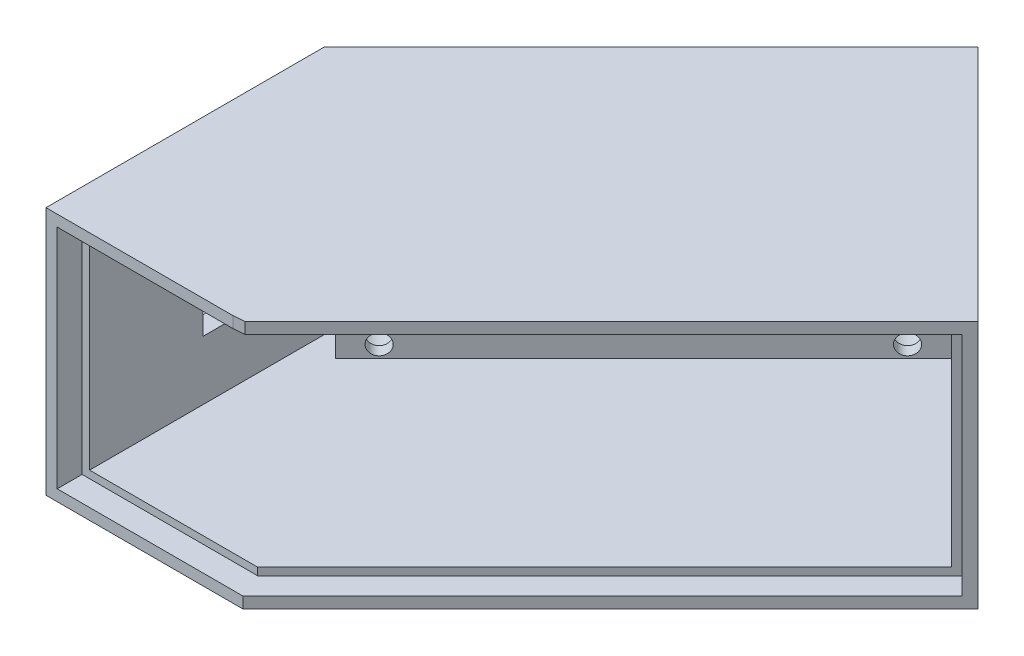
ISO-10303-21;
HEADER;
FILE_DESCRIPTION(('STEP AP214'),'2;1');
FILE_NAME('part.step','',(''),(''),'','','');
FILE_SCHEMA(('AUTOMOTIVE_DESIGN { 1 0 10303 214 1 1 1 1 }'));
ENDSEC;
DATA;
#1=APPLICATION_CONTEXT('core data for automotive mechanical design processes');
#2=APPLICATION_PROTOCOL_DEFINITION('international standard','automotive_design',2000,#1);
#3=PRODUCT_CONTEXT('',#1,'mechanical');
#4=PRODUCT('Part','Part','',(#3));
#5=PRODUCT_RELATED_PRODUCT_CATEGORY('part','',(#4));
#6=PRODUCT_DEFINITION_FORMATION('','',#4);
#7=PRODUCT_DEFINITION_CONTEXT('part definition',#1,'design');
#8=PRODUCT_DEFINITION('design','',#6,#7);
#9=PRODUCT_DEFINITION_SHAPE('','',#8);
#10=(LENGTH_UNIT() NAMED_UNIT(*) SI_UNIT(.MILLI.,.METRE.));
#11=(NAMED_UNIT(*) PLANE_ANGLE_UNIT() SI_UNIT($,.RADIAN.));
#12=(NAMED_UNIT(*) SI_UNIT($,.STERADIAN.) SOLID_ANGLE_UNIT());
#13=UNCERTAINTY_MEASURE_WITH_UNIT(LENGTH_MEASURE(1.E-05),#10,'distance_accuracy_value','');
#14=(GEOMETRIC_REPRESENTATION_CONTEXT(3) GLOBAL_UNCERTAINTY_ASSIGNED_CONTEXT((#13)) GLOBAL_UNIT_ASSIGNED_CONTEXT((#10,
#11,#12)) REPRESENTATION_CONTEXT('',''));
#15=CARTESIAN_POINT('',(0.,0.,0.));
#16=DIRECTION('',(0.,0.,1.));
#17=DIRECTION('',(1.,0.,0.));
#18=AXIS2_PLACEMENT_3D('',#15,#16,#17);
#19=CARTESIAN_POINT('',(-22.7790319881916,35.,-108.371089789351));
#20=DIRECTION('',(0.707106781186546,0.,0.707106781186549));
#21=DIRECTION('',(0.707106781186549,0.,-0.707106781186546));
#22=AXIS2_PLACEMENT_3D('',#19,#20,#21);
#23=CYLINDRICAL_SURFACE('',#22,1.59999999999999);
#24=CARTESIAN_POINT('',(9.8221261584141,35.,-75.7699316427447));
#25=DIRECTION('',(0.707106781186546,0.,0.707106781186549));
#26=DIRECTION('',(0.707106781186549,0.,-0.707106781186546));
#27=AXIS2_PLACEMENT_3D('',#24,#25,#26);
#28=CIRCLE('',#27,1.6);
#29=CARTESIAN_POINT('',(10.9534970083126,35.,-76.9013024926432));
#30=VERTEX_POINT('',#29);
#31=EDGE_CURVE('E284',#30,#30,#28,.T.);
#32=ORIENTED_EDGE('',*,*,#31,.T.);
#33=EDGE_LOOP('',(#32));
#34=FACE_BOUND('',#33,.T.);
#35=CARTESIAN_POINT('',(8.407912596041,35.,-77.1841452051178));
#36=DIRECTION('',(-0.707106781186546,0.,-0.707106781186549));
#37=DIRECTION('',(-0.707106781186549,0.,0.707106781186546));
#38=AXIS2_PLACEMENT_3D('',#35,#36,#37);
#39=CIRCLE('',#38,1.59999999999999);
#40=CARTESIAN_POINT('',(7.27654174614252,35.,-76.0527743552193));
#41=VERTEX_POINT('',#40);
#42=EDGE_CURVE('E277',#41,#41,#39,.F.);
#43=ORIENTED_EDGE('',*,*,#42,.F.);
#44=EDGE_LOOP('',(#43));
#45=FACE_BOUND('',#44,.T.);
#46=ADVANCED_FACE('F34',(#34,#45),#23,.F.);
#47=CARTESIAN_POINT('',(-65.2054388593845,4.99999999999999,-65.9446829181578));
#48=DIRECTION('',(0.707106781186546,0.,0.707106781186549));
#49=DIRECTION('',(0.707106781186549,0.,-0.707106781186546));
#50=AXIS2_PLACEMENT_3D('',#47,#48,#49);
#51=CYLINDRICAL_SURFACE('',#50,1.6);
#52=CARTESIAN_POINT('',(-32.6042807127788,4.99999999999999,-33.343524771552));
#53=DIRECTION('',(0.707106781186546,0.,0.707106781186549));
#54=DIRECTION('',(0.707106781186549,0.,-0.707106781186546));
#55=AXIS2_PLACEMENT_3D('',#52,#53,#54);
#56=CIRCLE('',#55,1.59999999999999);
#57=CARTESIAN_POINT('',(-31.4729098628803,4.99999999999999,-34.4748956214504));
#58=VERTEX_POINT('',#57);
#59=EDGE_CURVE('E278',#58,#58,#56,.T.);
#60=ORIENTED_EDGE('',*,*,#59,.T.);
#61=EDGE_LOOP('',(#60));
#62=FACE_BOUND('',#61,.T.);
#63=CARTESIAN_POINT('',(-34.0184942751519,4.99999999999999,-34.7577383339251));
#64=DIRECTION('',(-0.707106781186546,0.,-0.707106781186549));
#65=DIRECTION('',(-0.707106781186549,0.,0.707106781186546));
#66=AXIS2_PLACEMENT_3D('',#63,#64,#65);
#67=CIRCLE('',#66,1.6);
#68=CARTESIAN_POINT('',(-35.1498651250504,4.99999999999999,-33.6263674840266));
#69=VERTEX_POINT('',#68);
#70=EDGE_CURVE('E462',#69,#69,#67,.F.);
#71=ORIENTED_EDGE('',*,*,#70,.F.);
#72=EDGE_LOOP('',(#71));
#73=FACE_BOUND('',#72,.T.);
#74=ADVANCED_FACE('F511',(#62,#73),#51,.F.);
#75=CARTESIAN_POINT('',(-22.7790319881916,5.,-108.371089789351));
#76=DIRECTION('',(0.707106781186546,0.,0.707106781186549));
#77=DIRECTION('',(0.707106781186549,0.,-0.707106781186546));
#78=AXIS2_PLACEMENT_3D('',#75,#76,#77);
#79=CYLINDRICAL_SURFACE('',#78,1.59999999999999);
#80=CARTESIAN_POINT('',(9.8221261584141,5.,-75.7699316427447));
#81=DIRECTION('',(0.707106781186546,0.,0.707106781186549));
#82=DIRECTION('',(0.707106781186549,0.,-0.707106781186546));
#83=AXIS2_PLACEMENT_3D('',#80,#81,#82);
#84=CIRCLE('',#83,1.59999999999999);
#85=CARTESIAN_POINT('',(10.9534970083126,5.,-76.9013024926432));
#86=VERTEX_POINT('',#85);
#87=EDGE_CURVE('E281',#86,#86,#84,.T.);
#88=ORIENTED_EDGE('',*,*,#87,.T.);
#89=EDGE_LOOP('',(#88));
#90=FACE_BOUND('',#89,.T.);
#91=CARTESIAN_POINT('',(8.40791259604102,5.,-77.1841452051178));
#92=DIRECTION('',(-0.707106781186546,0.,-0.707106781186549));
#93=DIRECTION('',(-0.707106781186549,0.,0.707106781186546));
#94=AXIS2_PLACEMENT_3D('',#91,#92,#93);
#95=CIRCLE('',#94,1.59999999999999);
#96=CARTESIAN_POINT('',(7.27654174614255,5.,-76.0527743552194));
#97=VERTEX_POINT('',#96);
#98=EDGE_CURVE('E255',#97,#97,#95,.F.);
#99=ORIENTED_EDGE('',*,*,#98,.F.);
#100=EDGE_LOOP('',(#99));
#101=FACE_BOUND('',#100,.T.);
#102=ADVANCED_FACE('F517',(#90,#101),#79,.F.);
#103=CARTESIAN_POINT('',(-65.2054388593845,35.,-65.9446829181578));
#104=DIRECTION('',(0.707106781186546,0.,0.707106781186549));
#105=DIRECTION('',(0.707106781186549,0.,-0.707106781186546));
#106=AXIS2_PLACEMENT_3D('',#103,#104,#105);
#107=CYLINDRICAL_SURFACE('',#106,1.6);
#108=CARTESIAN_POINT('',(-32.6042807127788,35.,-33.343524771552));
#109=DIRECTION('',(0.707106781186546,0.,0.707106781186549));
#110=DIRECTION('',(0.707106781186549,0.,-0.707106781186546));
#111=AXIS2_PLACEMENT_3D('',#108,#109,#110);
#112=CIRCLE('',#111,1.6);
#113=CARTESIAN_POINT('',(-31.4729098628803,35.,-34.4748956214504));
#114=VERTEX_POINT('',#113);
#115=EDGE_CURVE('E287',#114,#114,#112,.T.);
#116=ORIENTED_EDGE('',*,*,#115,.T.);
#117=EDGE_LOOP('',(#116));
#118=FACE_BOUND('',#117,.T.);
#119=CARTESIAN_POINT('',(-34.0184942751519,35.,-34.757738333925));
#120=DIRECTION('',(-0.707106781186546,0.,-0.707106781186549));
#121=DIRECTION('',(-0.707106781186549,0.,0.707106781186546));
#122=AXIS2_PLACEMENT_3D('',#119,#120,#121);
#123=CIRCLE('',#122,1.6);
#124=CARTESIAN_POINT('',(-35.1498651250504,35.,-33.6263674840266));
#125=VERTEX_POINT('',#124);
#126=EDGE_CURVE('E273',#125,#125,#123,.F.);
#127=ORIENTED_EDGE('',*,*,#126,.F.);
#128=EDGE_LOOP('',(#127));
#129=FACE_BOUND('',#128,.T.);
#130=ADVANCED_FACE('F557',(#118,#129),#107,.F.);
#131=CARTESIAN_POINT('',(6.99369903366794,40.,-85.6694265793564));
#132=DIRECTION('',(-0.707106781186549,0.,0.707106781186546));
#133=DIRECTION('',(0.707106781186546,0.,0.707106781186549));
#134=AXIS2_PLACEMENT_3D('',#131,#132,#133);
#135=PLANE('',#134);
#136=DIRECTION('',(-0.707106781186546,0.,-0.707106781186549));
#137=VECTOR('',#136,1.);
#138=CARTESIAN_POINT('',(46.3315628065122,37.,-46.331562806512));
#139=LINE('',#138,#137);
#140=CARTESIAN_POINT('',(42.3490380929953,37.,-50.3140875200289));
#141=VERTEX_POINT('',#140);
#142=CARTESIAN_POINT('',(13.3576600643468,37.,-79.3054655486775));
#143=VERTEX_POINT('',#142);
#144=EDGE_CURVE('E413',#141,#143,#139,.T.);
#145=ORIENTED_EDGE('',*,*,#144,.T.);
#146=DIRECTION('',(0.,1.,0.));
#147=VECTOR('',#146,1.);
#148=CARTESIAN_POINT('',(13.3576600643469,3.00000000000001,-79.3054655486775));
#149=LINE('',#148,#147);
#150=CARTESIAN_POINT('',(13.3576600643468,3.,-79.3054655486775));
#151=VERTEX_POINT('',#150);
#152=EDGE_CURVE('E299',#151,#143,#149,.T.);
#153=ORIENTED_EDGE('',*,*,#152,.F.);
#154=DIRECTION('',(-0.707106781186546,0.,-0.707106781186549));
#155=VECTOR('',#154,1.);
#156=CARTESIAN_POINT('',(46.3315628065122,3.,-46.331562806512));
#157=LINE('',#156,#155);
#158=CARTESIAN_POINT('',(42.3490380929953,3.,-50.3140875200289));
#159=VERTEX_POINT('',#158);
#160=EDGE_CURVE('E408',#159,#151,#157,.T.);
#161=ORIENTED_EDGE('',*,*,#160,.F.);
#162=DIRECTION('',(0.,-1.,0.));
#163=VECTOR('',#162,1.);
#164=CARTESIAN_POINT('',(42.3490380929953,40.,-50.3140875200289));
#165=LINE('',#164,#163);
#166=EDGE_CURVE('E421',#141,#159,#165,.T.);
#167=ORIENTED_EDGE('',*,*,#166,.F.);
#168=EDGE_LOOP('',(#145,#153,#161,#167));
#169=FACE_BOUND('',#168,.T.);
#170=ADVANCED_FACE('F553',(#169),#135,.T.);
#171=CARTESIAN_POINT('',(0.,37.,0.));
#172=DIRECTION('',(0.,-1.,0.));
#173=DIRECTION('',(0.,0.,-1.));
#174=AXIS2_PLACEMENT_3D('',#171,#172,#173);
#175=PLANE('',#174);
#176=DIRECTION('',(-0.707106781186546,0.,-0.707106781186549));
#177=VECTOR('',#176,1.);
#178=CARTESIAN_POINT('',(-36.1167341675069,37.,-29.8310713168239));
#179=LINE('',#178,#177);
#180=CARTESIAN_POINT('',(-36.1167341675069,37.,-29.8310713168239));
#181=VERTEX_POINT('',#180);
#182=CARTESIAN_POINT('',(-40.3593748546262,37.,-34.0737120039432));
#183=VERTEX_POINT('',#182);
#184=EDGE_CURVE('E304',#181,#183,#179,.T.);
#185=ORIENTED_EDGE('',*,*,#184,.F.);
#186=DIRECTION('',(-0.707106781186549,0.,0.707106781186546));
#187=VECTOR('',#186,1.);
#188=CARTESIAN_POINT('',(13.3576600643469,37.,-79.3054655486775));
#189=LINE('',#188,#187);
#190=EDGE_CURVE('E290',#143,#181,#189,.T.);
#191=ORIENTED_EDGE('',*,*,#190,.F.);
#192=ORIENTED_EDGE('',*,*,#144,.F.);
#193=DIRECTION('',(0.707106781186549,0.,-0.707106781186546));
#194=VECTOR('',#193,1.);
#195=CARTESIAN_POINT('',(-3.98252471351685,37.,-3.98252471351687));
#196=LINE('',#195,#194);
#197=CARTESIAN_POINT('',(-13.3593748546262,37.,5.39432542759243));
#198=VERTEX_POINT('',#197);
#199=EDGE_CURVE('E417',#198,#141,#196,.T.);
#200=ORIENTED_EDGE('',*,*,#199,.F.);
#201=DIRECTION('',(1.,0.,0.));
#202=VECTOR('',#201,1.);
#203=CARTESIAN_POINT('',(0.,37.,5.39432542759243));
#204=LINE('',#203,#202);
#205=CARTESIAN_POINT('',(-40.3593748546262,37.,5.39432542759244));
#206=VERTEX_POINT('',#205);
#207=EDGE_CURVE('E424',#206,#198,#204,.T.);
#208=ORIENTED_EDGE('',*,*,#207,.F.);
#209=DIRECTION('',(0.,0.,1.));
#210=VECTOR('',#209,1.);
#211=CARTESIAN_POINT('',(-40.3593748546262,37.,0.));
#212=LINE('',#211,#210);
#213=EDGE_CURVE('E416',#183,#206,#212,.T.);
#214=ORIENTED_EDGE('',*,*,#213,.F.);
#215=EDGE_LOOP('',(#185,#191,#192,#200,#208,#214));
#216=FACE_BOUND('',#215,.T.);
#217=ADVANCED_FACE('F556',(#216),#175,.T.);
#218=CARTESIAN_POINT('',(0.,3.,0.));
#219=DIRECTION('',(0.,-1.,0.));
#220=DIRECTION('',(0.,0.,-1.));
#221=AXIS2_PLACEMENT_3D('',#218,#219,#220);
#222=PLANE('',#221);
#223=DIRECTION('',(0.707106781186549,0.,-0.707106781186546));
#224=VECTOR('',#223,1.);
#225=CARTESIAN_POINT('',(13.3576600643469,3.00000000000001,-79.3054655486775));
#226=LINE('',#225,#224);
#227=CARTESIAN_POINT('',(-36.1167341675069,3.,-29.8310713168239));
#228=VERTEX_POINT('',#227);
#229=EDGE_CURVE('E296',#228,#151,#226,.T.);
#230=ORIENTED_EDGE('',*,*,#229,.F.);
#231=DIRECTION('',(-0.707106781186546,0.,-0.707106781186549));
#232=VECTOR('',#231,1.);
#233=CARTESIAN_POINT('',(-36.1167341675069,3.,-29.8310713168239));
#234=LINE('',#233,#232);
#235=CARTESIAN_POINT('',(-40.3593748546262,3.,-34.0737120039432));
#236=VERTEX_POINT('',#235);
#237=EDGE_CURVE('E302',#228,#236,#234,.T.);
#238=ORIENTED_EDGE('',*,*,#237,.T.);
#239=DIRECTION('',(0.,0.,1.));
#240=VECTOR('',#239,1.);
#241=CARTESIAN_POINT('',(-40.3593748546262,3.,0.));
#242=LINE('',#241,#240);
#243=CARTESIAN_POINT('',(-40.3593748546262,3.,5.39432542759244));
#244=VERTEX_POINT('',#243);
#245=EDGE_CURVE('E411',#236,#244,#242,.T.);
#246=ORIENTED_EDGE('',*,*,#245,.T.);
#247=DIRECTION('',(1.,0.,0.));
#248=VECTOR('',#247,1.);
#249=CARTESIAN_POINT('',(0.,3.,5.39432542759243));
#250=LINE('',#249,#248);
#251=CARTESIAN_POINT('',(-13.3593748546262,3.,5.39432542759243));
#252=VERTEX_POINT('',#251);
#253=EDGE_CURVE('E407',#244,#252,#250,.T.);
#254=ORIENTED_EDGE('',*,*,#253,.T.);
#255=DIRECTION('',(0.707106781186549,0.,-0.707106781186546));
#256=VECTOR('',#255,1.);
#257=CARTESIAN_POINT('',(-3.98252471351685,3.,-3.98252471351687));
#258=LINE('',#257,#256);
#259=EDGE_CURVE('E412',#252,#159,#258,.T.);
#260=ORIENTED_EDGE('',*,*,#259,.T.);
#261=ORIENTED_EDGE('',*,*,#160,.T.);
#262=EDGE_LOOP('',(#230,#238,#246,#254,#260,#261));
#263=FACE_BOUND('',#262,.T.);
#264=ADVANCED_FACE('F565',(#263),#222,.F.);
#265=CARTESIAN_POINT('',(-13.3593748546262,40.,5.39432542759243));
#266=DIRECTION('',(0.,0.,-1.));
#267=DIRECTION('',(-1.,0.,0.));
#268=AXIS2_PLACEMENT_3D('',#265,#266,#267);
#269=PLANE('',#268);
#270=DIRECTION('',(-1.,0.,0.));
#271=VECTOR('',#270,1.);
#272=CARTESIAN_POINT('',(-13.3593748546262,1.79999999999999,5.39432542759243));
#273=LINE('',#272,#271);
#274=CARTESIAN_POINT('',(-13.3593748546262,1.79999999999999,5.39432542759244));
#275=VERTEX_POINT('',#274);
#276=CARTESIAN_POINT('',(-41.5593748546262,1.79999999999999,5.39432542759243));
#277=VERTEX_POINT('',#276);
#278=EDGE_CURVE('E347',#275,#277,#273,.T.);
#279=ORIENTED_EDGE('',*,*,#278,.F.);
#280=DIRECTION('',(0.,-1.,0.));
#281=VECTOR('',#280,1.);
#282=CARTESIAN_POINT('',(-13.3593748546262,40.,5.39432542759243));
#283=LINE('',#282,#281);
#284=EDGE_CURVE('E454',#252,#275,#283,.T.);
#285=ORIENTED_EDGE('',*,*,#284,.F.);
#286=ORIENTED_EDGE('',*,*,#253,.F.);
#287=DIRECTION('',(0.,-1.,0.));
#288=VECTOR('',#287,1.);
#289=CARTESIAN_POINT('',(-40.3593748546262,40.,5.39432542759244));
#290=LINE('',#289,#288);
#291=EDGE_CURVE('E422',#206,#244,#290,.T.);
#292=ORIENTED_EDGE('',*,*,#291,.F.);
#293=ORIENTED_EDGE('',*,*,#207,.T.);
#294=CARTESIAN_POINT('',(-13.3593748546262,38.2,5.39432542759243));
#295=VERTEX_POINT('',#294);
#296=EDGE_CURVE('E455',#295,#198,#283,.T.);
#297=ORIENTED_EDGE('',*,*,#296,.F.);
#298=DIRECTION('',(1.,0.,0.));
#299=VECTOR('',#298,1.);
#300=CARTESIAN_POINT('',(-41.5593748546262,38.2,5.39432542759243));
#301=LINE('',#300,#299);
#302=CARTESIAN_POINT('',(-41.5593748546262,38.2,5.39432542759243));
#303=VERTEX_POINT('',#302);
#304=EDGE_CURVE('E351',#303,#295,#301,.T.);
#305=ORIENTED_EDGE('',*,*,#304,.F.);
#306=DIRECTION('',(0.,1.,0.));
#307=VECTOR('',#306,1.);
#308=CARTESIAN_POINT('',(-41.5593748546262,1.79999999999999,5.39432542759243));
#309=LINE('',#308,#307);
#310=EDGE_CURVE('E370',#277,#303,#309,.T.);
#311=ORIENTED_EDGE('',*,*,#310,.F.);
#312=EDGE_LOOP('',(#279,#285,#286,#292,#293,#297,#305,#311));
#313=FACE_BOUND('',#312,.T.);
#314=ADVANCED_FACE('F569',(#313),#269,.F.);
#315=CARTESIAN_POINT('',(44.470358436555,40.,-52.4354078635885));
#316=DIRECTION('',(-0.707106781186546,0.,-0.707106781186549));
#317=DIRECTION('',(-0.707106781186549,0.,0.707106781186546));
#318=AXIS2_PLACEMENT_3D('',#315,#316,#317);
#319=PLANE('',#318);
#320=DIRECTION('',(0.707106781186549,0.,-0.707106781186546));
#321=VECTOR('',#320,1.);
#322=CARTESIAN_POINT('',(-13.3593748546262,38.2,5.39432542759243));
#323=LINE('',#322,#321);
#324=CARTESIAN_POINT('',(43.1975662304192,38.2,-51.1626156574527));
#325=VERTEX_POINT('',#324);
#326=EDGE_CURVE('E378',#295,#325,#323,.T.);
#327=ORIENTED_EDGE('',*,*,#326,.F.);
#328=ORIENTED_EDGE('',*,*,#296,.T.);
#329=ORIENTED_EDGE('',*,*,#199,.T.);
#330=ORIENTED_EDGE('',*,*,#166,.T.);
#331=ORIENTED_EDGE('',*,*,#259,.F.);
#332=ORIENTED_EDGE('',*,*,#284,.T.);
#333=DIRECTION('',(-0.707106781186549,0.,0.707106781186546));
#334=VECTOR('',#333,1.);
#335=CARTESIAN_POINT('',(43.1975662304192,1.8,-51.1626156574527));
#336=LINE('',#335,#334);
#337=CARTESIAN_POINT('',(43.1975662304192,1.8,-51.1626156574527));
#338=VERTEX_POINT('',#337);
#339=EDGE_CURVE('E382',#338,#275,#336,.T.);
#340=ORIENTED_EDGE('',*,*,#339,.F.);
#341=DIRECTION('',(0.,-1.,0.));
#342=VECTOR('',#341,1.);
#343=CARTESIAN_POINT('',(43.1975662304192,38.2,-51.1626156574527));
#344=LINE('',#343,#342);
#345=EDGE_CURVE('E397',#325,#338,#344,.T.);
#346=ORIENTED_EDGE('',*,*,#345,.F.);
#347=EDGE_LOOP('',(#327,#328,#329,#330,#331,#332,#340,#346));
#348=FACE_BOUND('',#347,.T.);
#349=ADVANCED_FACE('F589',(#348),#319,.F.);
#350=CARTESIAN_POINT('',(9.11501937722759,40.,-87.790746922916));
#351=DIRECTION('',(-0.707106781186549,0.,0.707106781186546));
#352=DIRECTION('',(0.707106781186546,0.,0.707106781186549));
#353=AXIS2_PLACEMENT_3D('',#350,#351,#352);
#354=PLANE('',#353);
#355=DIRECTION('',(-0.707106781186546,0.,-0.707106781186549));
#356=VECTOR('',#355,1.);
#357=CARTESIAN_POINT('',(9.11501937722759,0.,-87.790746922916));
#358=LINE('',#357,#356);
#359=CARTESIAN_POINT('',(47.2987855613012,0.,-49.6069807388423));
#360=VERTEX_POINT('',#359);
#361=CARTESIAN_POINT('',(9.11501937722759,0.,-87.790746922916));
#362=VERTEX_POINT('',#361);
#363=EDGE_CURVE('E428',#360,#362,#358,.T.);
#364=ORIENTED_EDGE('',*,*,#363,.T.);
#365=DIRECTION('',(0.,-1.,0.));
#366=VECTOR('',#365,1.);
#367=CARTESIAN_POINT('',(9.11501937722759,40.,-87.790746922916));
#368=LINE('',#367,#366);
#369=CARTESIAN_POINT('',(9.11501937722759,40.,-87.790746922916));
#370=VERTEX_POINT('',#369);
#371=EDGE_CURVE('E451',#370,#362,#368,.T.);
#372=ORIENTED_EDGE('',*,*,#371,.F.);
#373=DIRECTION('',(-0.707106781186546,0.,-0.707106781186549));
#374=VECTOR('',#373,1.);
#375=CARTESIAN_POINT('',(9.11501937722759,40.,-87.790746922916));
#376=LINE('',#375,#374);
#377=CARTESIAN_POINT('',(47.2987855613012,40.,-49.6069807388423));
#378=VERTEX_POINT('',#377);
#379=EDGE_CURVE('E437',#378,#370,#376,.T.);
#380=ORIENTED_EDGE('',*,*,#379,.F.);
#381=DIRECTION('',(0.,1.,0.));
#382=VECTOR('',#381,1.);
#383=CARTESIAN_POINT('',(47.2987855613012,40.,-49.6069807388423));
#384=LINE('',#383,#382);
#385=EDGE_CURVE('E389',#360,#378,#384,.T.);
#386=ORIENTED_EDGE('',*,*,#385,.F.);
#387=EDGE_LOOP('',(#364,#372,#380,#386));
#388=FACE_BOUND('',#387,.T.);
#389=ADVANCED_FACE('F585',(#388),#354,.F.);
#390=CARTESIAN_POINT('',(-43.3593748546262,40.,-35.3163526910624));
#391=DIRECTION('',(0.707106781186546,0.,0.707106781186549));
#392=DIRECTION('',(0.707106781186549,0.,-0.707106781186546));
#393=AXIS2_PLACEMENT_3D('',#390,#391,#392);
#394=PLANE('',#393);
#395=CARTESIAN_POINT('',(-38.9682417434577,4.99999999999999,-39.7074858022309));
#396=DIRECTION('',(-0.707106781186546,0.,-0.707106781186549));
#397=DIRECTION('',(-0.707106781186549,0.,0.707106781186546));
#398=AXIS2_PLACEMENT_3D('',#395,#396,#397);
#399=CIRCLE('',#398,3.10000000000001);
#400=CARTESIAN_POINT('',(-41.160272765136,4.99999999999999,-37.5154547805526));
#401=VERTEX_POINT('',#400);
#402=EDGE_CURVE('E256',#401,#401,#399,.T.);
#403=ORIENTED_EDGE('',*,*,#402,.F.);
#404=EDGE_LOOP('',(#403));
#405=FACE_BOUND('',#404,.T.);
#406=CARTESIAN_POINT('',(3.45816512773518,5.,-82.1338926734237));
#407=DIRECTION('',(-0.707106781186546,0.,-0.707106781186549));
#408=DIRECTION('',(-0.707106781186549,0.,0.707106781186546));
#409=AXIS2_PLACEMENT_3D('',#406,#407,#408);
#410=CIRCLE('',#409,3.09999999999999);
#411=CARTESIAN_POINT('',(1.26613410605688,5.,-79.9418616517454));
#412=VERTEX_POINT('',#411);
#413=EDGE_CURVE('E262',#412,#412,#410,.T.);
#414=ORIENTED_EDGE('',*,*,#413,.F.);
#415=EDGE_LOOP('',(#414));
#416=FACE_BOUND('',#415,.T.);
#417=CARTESIAN_POINT('',(3.45816512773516,35.,-82.1338926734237));
#418=DIRECTION('',(-0.707106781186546,0.,-0.707106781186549));
#419=DIRECTION('',(-0.707106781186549,0.,0.707106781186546));
#420=AXIS2_PLACEMENT_3D('',#417,#418,#419);
#421=CIRCLE('',#420,3.1);
#422=CARTESIAN_POINT('',(1.26613410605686,35.,-79.9418616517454));
#423=VERTEX_POINT('',#422);
#424=EDGE_CURVE('E248',#423,#423,#421,.T.);
#425=ORIENTED_EDGE('',*,*,#424,.F.);
#426=EDGE_LOOP('',(#425));
#427=FACE_BOUND('',#426,.T.);
#428=CARTESIAN_POINT('',(-38.9682417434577,35.,-39.7074858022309));
#429=DIRECTION('',(-0.707106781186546,0.,-0.707106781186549));
#430=DIRECTION('',(-0.707106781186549,0.,0.707106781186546));
#431=AXIS2_PLACEMENT_3D('',#428,#429,#430);
#432=CIRCLE('',#431,3.1);
#433=CARTESIAN_POINT('',(-41.160272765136,35.,-37.5154547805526));
#434=VERTEX_POINT('',#433);
#435=EDGE_CURVE('E274',#434,#434,#432,.T.);
#436=ORIENTED_EDGE('',*,*,#435,.F.);
#437=EDGE_LOOP('',(#436));
#438=FACE_BOUND('',#437,.T.);
#439=DIRECTION('',(-0.707106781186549,0.,0.707106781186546));
#440=VECTOR('',#439,1.);
#441=CARTESIAN_POINT('',(-43.3593748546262,0.,-35.3163526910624));
#442=LINE('',#441,#440);
#443=CARTESIAN_POINT('',(-43.3593748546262,0.,-35.3163526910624));
#444=VERTEX_POINT('',#443);
#445=EDGE_CURVE('E446',#362,#444,#442,.T.);
#446=ORIENTED_EDGE('',*,*,#445,.T.);
#447=DIRECTION('',(0.,-1.,0.));
#448=VECTOR('',#447,1.);
#449=CARTESIAN_POINT('',(-43.3593748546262,40.,-35.3163526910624));
#450=LINE('',#449,#448);
#451=CARTESIAN_POINT('',(-43.3593748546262,40.,-35.3163526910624));
#452=VERTEX_POINT('',#451);
#453=EDGE_CURVE('E444',#452,#444,#450,.T.);
#454=ORIENTED_EDGE('',*,*,#453,.F.);
#455=DIRECTION('',(-0.707106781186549,0.,0.707106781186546));
#456=VECTOR('',#455,1.);
#457=CARTESIAN_POINT('',(-43.3593748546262,40.,-35.3163526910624));
#458=LINE('',#457,#456);
#459=EDGE_CURVE('E439',#370,#452,#458,.T.);
#460=ORIENTED_EDGE('',*,*,#459,.F.);
#461=ORIENTED_EDGE('',*,*,#371,.T.);
#462=EDGE_LOOP('',(#446,#454,#460,#461));
#463=FACE_BOUND('',#462,.T.);
#464=ADVANCED_FACE('F581',(#405,#416,#427,#438,#463),#394,.F.);
#465=CARTESIAN_POINT('',(-43.3593748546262,40.,5.39432542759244));
#466=DIRECTION('',(1.,0.,0.));
#467=DIRECTION('',(0.,0.,-1.));
#468=AXIS2_PLACEMENT_3D('',#465,#466,#467);
#469=PLANE('',#468);
#470=DIRECTION('',(0.,0.,1.));
#471=VECTOR('',#470,1.);
#472=CARTESIAN_POINT('',(-43.3593748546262,12.5,-12.8076408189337));
#473=LINE('',#472,#471);
#474=CARTESIAN_POINT('',(-43.3593748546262,12.5,-25.6076408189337));
#475=VERTEX_POINT('',#474);
#476=CARTESIAN_POINT('',(-43.3593748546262,12.5,-12.8076408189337));
#477=VERTEX_POINT('',#476);
#478=EDGE_CURVE('E311',#475,#477,#473,.T.);
#479=ORIENTED_EDGE('',*,*,#478,.F.);
#480=DIRECTION('',(0.,-1.,0.));
#481=VECTOR('',#480,1.);
#482=CARTESIAN_POINT('',(-43.3593748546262,12.5,-25.6076408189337));
#483=LINE('',#482,#481);
#484=CARTESIAN_POINT('',(-43.3593748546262,27.5,-25.6076408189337));
#485=VERTEX_POINT('',#484);
#486=EDGE_CURVE('E314',#485,#475,#483,.T.);
#487=ORIENTED_EDGE('',*,*,#486,.F.);
#488=DIRECTION('',(0.,0.,-1.));
#489=VECTOR('',#488,1.);
#490=CARTESIAN_POINT('',(-43.3593748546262,27.5,-12.8076408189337));
#491=LINE('',#490,#489);
#492=CARTESIAN_POINT('',(-43.3593748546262,27.5,-12.8076408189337));
#493=VERTEX_POINT('',#492);
#494=EDGE_CURVE('E316',#493,#485,#491,.T.);
#495=ORIENTED_EDGE('',*,*,#494,.F.);
#496=DIRECTION('',(0.,1.,0.));
#497=VECTOR('',#496,1.);
#498=CARTESIAN_POINT('',(-43.3593748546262,12.5,-12.8076408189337));
#499=LINE('',#498,#497);
#500=EDGE_CURVE('E308',#477,#493,#499,.T.);
#501=ORIENTED_EDGE('',*,*,#500,.F.);
#502=EDGE_LOOP('',(#479,#487,#495,#501));
#503=FACE_BOUND('',#502,.T.);
#504=DIRECTION('',(0.,0.,1.));
#505=VECTOR('',#504,1.);
#506=CARTESIAN_POINT('',(-43.3593748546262,0.,5.39432542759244));
#507=LINE('',#506,#505);
#508=CARTESIAN_POINT('',(-43.3593748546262,0.,9.39432542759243));
#509=VERTEX_POINT('',#508);
#510=EDGE_CURVE('E440',#444,#509,#507,.T.);
#511=ORIENTED_EDGE('',*,*,#510,.T.);
#512=DIRECTION('',(0.,-1.,0.));
#513=VECTOR('',#512,1.);
#514=CARTESIAN_POINT('',(-43.3593748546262,40.,9.39432542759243));
#515=LINE('',#514,#513);
#516=CARTESIAN_POINT('',(-43.3593748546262,40.,9.39432542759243));
#517=VERTEX_POINT('',#516);
#518=EDGE_CURVE('E362',#517,#509,#515,.T.);
#519=ORIENTED_EDGE('',*,*,#518,.F.);
#520=DIRECTION('',(0.,0.,1.));
#521=VECTOR('',#520,1.);
#522=CARTESIAN_POINT('',(-43.3593748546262,40.,5.39432542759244));
#523=LINE('',#522,#521);
#524=EDGE_CURVE('E442',#452,#517,#523,.T.);
#525=ORIENTED_EDGE('',*,*,#524,.F.);
#526=ORIENTED_EDGE('',*,*,#453,.T.);
#527=EDGE_LOOP('',(#511,#519,#525,#526));
#528=FACE_BOUND('',#527,.T.);
#529=ADVANCED_FACE('F574',(#503,#528),#469,.F.);
#530=CARTESIAN_POINT('',(0.,40.,0.));
#531=DIRECTION('',(0.,-1.,0.));
#532=DIRECTION('',(0.,0.,-1.));
#533=AXIS2_PLACEMENT_3D('',#530,#531,#532);
#534=PLANE('',#533);
#535=ORIENTED_EDGE('',*,*,#524,.T.);
#536=DIRECTION('',(-1.,0.,0.));
#537=VECTOR('',#536,1.);
#538=CARTESIAN_POINT('',(-13.3593748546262,40.,9.39432542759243));
#539=LINE('',#538,#537);
#540=CARTESIAN_POINT('',(-13.3593748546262,40.,9.39432542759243));
#541=VERTEX_POINT('',#540);
#542=EDGE_CURVE('E359',#541,#517,#539,.T.);
#543=ORIENTED_EDGE('',*,*,#542,.F.);
#544=DIRECTION('',(0.996622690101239,0.,-0.0821170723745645));
#545=VECTOR('',#544,1.);
#546=CARTESIAN_POINT('',(-11.5537451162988,40.,9.2455499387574));
#547=LINE('',#546,#545);
#548=CARTESIAN_POINT('',(-11.5537451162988,40.,9.2455499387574));
#549=VERTEX_POINT('',#548);
#550=EDGE_CURVE('E336',#541,#549,#547,.T.);
#551=ORIENTED_EDGE('',*,*,#550,.T.);
#552=DIRECTION('',(-0.707106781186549,0.,0.707106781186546));
#553=VECTOR('',#552,1.);
#554=CARTESIAN_POINT('',(-10.53094772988,40.,8.22275255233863));
#555=LINE('',#554,#553);
#556=EDGE_CURVE('E392',#378,#549,#555,.T.);
#557=ORIENTED_EDGE('',*,*,#556,.F.);
#558=ORIENTED_EDGE('',*,*,#379,.T.);
#559=ORIENTED_EDGE('',*,*,#459,.T.);
#560=EDGE_LOOP('',(#535,#543,#551,#557,#558,#559));
#561=FACE_BOUND('',#560,.T.);
#562=ADVANCED_FACE('F571',(#561),#534,.F.);
#563=CARTESIAN_POINT('',(0.,0.,0.));
#564=DIRECTION('',(0.,-1.,0.));
#565=DIRECTION('',(0.,0.,-1.));
#566=AXIS2_PLACEMENT_3D('',#563,#564,#565);
#567=PLANE('',#566);
#568=DIRECTION('',(0.707106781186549,0.,-0.707106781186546));
#569=VECTOR('',#568,1.);
#570=CARTESIAN_POINT('',(47.2987855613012,0.,-49.6069807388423));
#571=LINE('',#570,#569);
#572=CARTESIAN_POINT('',(-11.7025206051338,0.,9.39432542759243));
#573=VERTEX_POINT('',#572);
#574=EDGE_CURVE('E386',#573,#360,#571,.T.);
#575=ORIENTED_EDGE('',*,*,#574,.F.);
#576=DIRECTION('',(1.,0.,0.));
#577=VECTOR('',#576,1.);
#578=CARTESIAN_POINT('',(-43.3593748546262,0.,9.39432542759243));
#579=LINE('',#578,#577);
#580=EDGE_CURVE('E365',#509,#573,#579,.T.);
#581=ORIENTED_EDGE('',*,*,#580,.F.);
#582=ORIENTED_EDGE('',*,*,#510,.F.);
#583=ORIENTED_EDGE('',*,*,#445,.F.);
#584=ORIENTED_EDGE('',*,*,#363,.F.);
#585=EDGE_LOOP('',(#575,#581,#582,#583,#584));
#586=FACE_BOUND('',#585,.T.);
#587=ADVANCED_FACE('F561',(#586),#567,.T.);
#588=CARTESIAN_POINT('',(-40.3593748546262,40.,5.39432542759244));
#589=DIRECTION('',(1.,0.,0.));
#590=DIRECTION('',(0.,0.,-1.));
#591=AXIS2_PLACEMENT_3D('',#588,#589,#590);
#592=PLANE('',#591);
#593=DIRECTION('',(0.,1.,0.));
#594=VECTOR('',#593,1.);
#595=CARTESIAN_POINT('',(-40.3593748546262,12.5,-25.6076408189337));
#596=LINE('',#595,#594);
#597=CARTESIAN_POINT('',(-40.3593748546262,12.5,-25.6076408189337));
#598=VERTEX_POINT('',#597);
#599=CARTESIAN_POINT('',(-40.3593748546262,27.5,-25.6076408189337));
#600=VERTEX_POINT('',#599);
#601=EDGE_CURVE('E307',#598,#600,#596,.T.);
#602=ORIENTED_EDGE('',*,*,#601,.F.);
#603=DIRECTION('',(0.,0.,-1.));
#604=VECTOR('',#603,1.);
#605=CARTESIAN_POINT('',(-40.3593748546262,12.5,-12.8076408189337));
#606=LINE('',#605,#604);
#607=CARTESIAN_POINT('',(-40.3593748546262,12.5,-12.8076408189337));
#608=VERTEX_POINT('',#607);
#609=EDGE_CURVE('E324',#608,#598,#606,.T.);
#610=ORIENTED_EDGE('',*,*,#609,.F.);
#611=DIRECTION('',(0.,-1.,0.));
#612=VECTOR('',#611,1.);
#613=CARTESIAN_POINT('',(-40.3593748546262,12.5,-12.8076408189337));
#614=LINE('',#613,#612);
#615=CARTESIAN_POINT('',(-40.3593748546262,27.5,-12.8076408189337));
#616=VERTEX_POINT('',#615);
#617=EDGE_CURVE('E321',#616,#608,#614,.T.);
#618=ORIENTED_EDGE('',*,*,#617,.F.);
#619=DIRECTION('',(0.,0.,1.));
#620=VECTOR('',#619,1.);
#621=CARTESIAN_POINT('',(-40.3593748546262,27.5,-12.8076408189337));
#622=LINE('',#621,#620);
#623=EDGE_CURVE('E318',#600,#616,#622,.T.);
#624=ORIENTED_EDGE('',*,*,#623,.F.);
#625=EDGE_LOOP('',(#602,#610,#618,#624));
#626=FACE_BOUND('',#625,.T.);
#627=ORIENTED_EDGE('',*,*,#245,.F.);
#628=DIRECTION('',(0.,-1.,0.));
#629=VECTOR('',#628,1.);
#630=CARTESIAN_POINT('',(-40.3593748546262,40.,-34.0737120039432));
#631=LINE('',#630,#629);
#632=EDGE_CURVE('E418',#183,#236,#631,.T.);
#633=ORIENTED_EDGE('',*,*,#632,.F.);
#634=ORIENTED_EDGE('',*,*,#213,.T.);
#635=ORIENTED_EDGE('',*,*,#291,.T.);
#636=EDGE_LOOP('',(#627,#633,#634,#635));
#637=FACE_BOUND('',#636,.T.);
#638=ADVANCED_FACE('F551',(#626,#637),#592,.T.);
#639=CARTESIAN_POINT('',(-10.53094772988,38.2,8.22275255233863));
#640=DIRECTION('',(0.,1.,0.));
#641=DIRECTION('',(0.,0.,1.));
#642=AXIS2_PLACEMENT_3D('',#639,#640,#641);
#643=PLANE('',#642);
#644=ORIENTED_EDGE('',*,*,#326,.T.);
#645=DIRECTION('',(-0.707106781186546,0.,-0.707106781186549));
#646=VECTOR('',#645,1.);
#647=CARTESIAN_POINT('',(46.0259933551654,38.2,-48.3341885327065));
#648=LINE('',#647,#646);
#649=CARTESIAN_POINT('',(46.0259933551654,38.2,-48.3341885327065));
#650=VERTEX_POINT('',#649);
#651=EDGE_CURVE('E404',#650,#325,#648,.T.);
#652=ORIENTED_EDGE('',*,*,#651,.F.);
#653=DIRECTION('',(0.707106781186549,0.,-0.707106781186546));
#654=VECTOR('',#653,1.);
#655=CARTESIAN_POINT('',(-10.53094772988,38.2,8.22275255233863));
#656=LINE('',#655,#654);
#657=CARTESIAN_POINT('',(-11.5537451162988,38.2,9.2455499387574));
#658=VERTEX_POINT('',#657);
#659=EDGE_CURVE('E379',#658,#650,#656,.T.);
#660=ORIENTED_EDGE('',*,*,#659,.F.);
#661=DIRECTION('',(-0.996622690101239,0.,0.0821170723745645));
#662=VECTOR('',#661,1.);
#663=CARTESIAN_POINT('',(-11.5537451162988,38.2,9.2455499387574));
#664=LINE('',#663,#662);
#665=CARTESIAN_POINT('',(-13.3593748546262,38.2,9.39432542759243));
#666=VERTEX_POINT('',#665);
#667=EDGE_CURVE('E342',#658,#666,#664,.T.);
#668=ORIENTED_EDGE('',*,*,#667,.T.);
#669=DIRECTION('',(1.,0.,0.));
#670=VECTOR('',#669,1.);
#671=CARTESIAN_POINT('',(-41.5593748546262,38.2,9.39432542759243));
#672=LINE('',#671,#670);
#673=CARTESIAN_POINT('',(-41.5593748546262,38.2,9.39432542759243));
#674=VERTEX_POINT('',#673);
#675=EDGE_CURVE('E353',#674,#666,#672,.T.);
#676=ORIENTED_EDGE('',*,*,#675,.F.);
#677=DIRECTION('',(0.,0.,-1.));
#678=VECTOR('',#677,1.);
#679=CARTESIAN_POINT('',(-41.5593748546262,38.2,9.39432542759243));
#680=LINE('',#679,#678);
#681=EDGE_CURVE('E368',#674,#303,#680,.T.);
#682=ORIENTED_EDGE('',*,*,#681,.T.);
#683=ORIENTED_EDGE('',*,*,#304,.T.);
#684=EDGE_LOOP('',(#644,#652,#660,#668,#676,#682,#683));
#685=FACE_BOUND('',#684,.T.);
#686=ADVANCED_FACE('F547',(#685),#643,.F.);
#687=CARTESIAN_POINT('',(46.0259933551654,38.2,-48.3341885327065));
#688=DIRECTION('',(0.707106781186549,0.,-0.707106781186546));
#689=DIRECTION('',(-0.707106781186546,0.,-0.707106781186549));
#690=AXIS2_PLACEMENT_3D('',#687,#688,#689);
#691=PLANE('',#690);
#692=ORIENTED_EDGE('',*,*,#345,.T.);
#693=DIRECTION('',(-0.707106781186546,0.,-0.707106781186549));
#694=VECTOR('',#693,1.);
#695=CARTESIAN_POINT('',(46.0259933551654,1.8,-48.3341885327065));
#696=LINE('',#695,#694);
#697=CARTESIAN_POINT('',(46.0259933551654,1.8,-48.3341885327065));
#698=VERTEX_POINT('',#697);
#699=EDGE_CURVE('E394',#698,#338,#696,.T.);
#700=ORIENTED_EDGE('',*,*,#699,.F.);
#701=DIRECTION('',(0.,-1.,0.));
#702=VECTOR('',#701,1.);
#703=CARTESIAN_POINT('',(46.0259933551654,38.2,-48.3341885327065));
#704=LINE('',#703,#702);
#705=EDGE_CURVE('E381',#650,#698,#704,.T.);
#706=ORIENTED_EDGE('',*,*,#705,.F.);
#707=ORIENTED_EDGE('',*,*,#651,.T.);
#708=EDGE_LOOP('',(#692,#700,#706,#707));
#709=FACE_BOUND('',#708,.T.);
#710=ADVANCED_FACE('F543',(#709),#691,.F.);
#711=CARTESIAN_POINT('',(46.0259933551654,1.8,-48.3341885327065));
#712=DIRECTION('',(0.,-1.,0.));
#713=DIRECTION('',(1.,0.,0.));
#714=AXIS2_PLACEMENT_3D('',#711,#712,#713);
#715=PLANE('',#714);
#716=ORIENTED_EDGE('',*,*,#339,.T.);
#717=ORIENTED_EDGE('',*,*,#278,.T.);
#718=DIRECTION('',(0.,0.,-1.));
#719=VECTOR('',#718,1.);
#720=CARTESIAN_POINT('',(-41.5593748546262,1.79999999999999,9.39432542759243));
#721=LINE('',#720,#719);
#722=CARTESIAN_POINT('',(-41.5593748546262,1.79999999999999,9.39432542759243));
#723=VERTEX_POINT('',#722);
#724=EDGE_CURVE('E375',#723,#277,#721,.T.);
#725=ORIENTED_EDGE('',*,*,#724,.F.);
#726=DIRECTION('',(-1.,0.,0.));
#727=VECTOR('',#726,1.);
#728=CARTESIAN_POINT('',(-13.3593748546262,1.79999999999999,9.39432542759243));
#729=LINE('',#728,#727);
#730=CARTESIAN_POINT('',(-11.7025206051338,1.79999999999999,9.39432542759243));
#731=VERTEX_POINT('',#730);
#732=EDGE_CURVE('E348',#731,#723,#729,.T.);
#733=ORIENTED_EDGE('',*,*,#732,.F.);
#734=DIRECTION('',(-0.707106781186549,0.,0.707106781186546));
#735=VECTOR('',#734,1.);
#736=CARTESIAN_POINT('',(46.0259933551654,1.8,-48.3341885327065));
#737=LINE('',#736,#735);
#738=EDGE_CURVE('E384',#698,#731,#737,.T.);
#739=ORIENTED_EDGE('',*,*,#738,.F.);
#740=ORIENTED_EDGE('',*,*,#699,.T.);
#741=EDGE_LOOP('',(#716,#717,#725,#733,#739,#740));
#742=FACE_BOUND('',#741,.T.);
#743=ADVANCED_FACE('F539',(#742),#715,.F.);
#744=CARTESIAN_POINT('',(-1.15409758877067,0.,-1.15409758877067));
#745=DIRECTION('',(-0.707106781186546,0.,-0.707106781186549));
#746=DIRECTION('',(-0.707106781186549,0.,0.707106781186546));
#747=AXIS2_PLACEMENT_3D('',#744,#745,#746);
#748=PLANE('',#747);
#749=ORIENTED_EDGE('',*,*,#556,.T.);
#750=DIRECTION('',(0.,1.,0.));
#751=VECTOR('',#750,1.);
#752=CARTESIAN_POINT('',(-11.5537451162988,33.3010205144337,9.2455499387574));
#753=LINE('',#752,#751);
#754=EDGE_CURVE('E339',#658,#549,#753,.T.);
#755=ORIENTED_EDGE('',*,*,#754,.F.);
#756=ORIENTED_EDGE('',*,*,#659,.T.);
#757=ORIENTED_EDGE('',*,*,#705,.T.);
#758=ORIENTED_EDGE('',*,*,#738,.T.);
#759=DIRECTION('',(0.,-1.,0.));
#760=VECTOR('',#759,1.);
#761=CARTESIAN_POINT('',(-11.7025206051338,6.69897948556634,9.39432542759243));
#762=LINE('',#761,#760);
#763=EDGE_CURVE('E344',#731,#573,#762,.T.);
#764=ORIENTED_EDGE('',*,*,#763,.T.);
#765=ORIENTED_EDGE('',*,*,#574,.T.);
#766=ORIENTED_EDGE('',*,*,#385,.T.);
#767=EDGE_LOOP('',(#749,#755,#756,#757,#758,#764,#765,#766));
#768=FACE_BOUND('',#767,.T.);
#769=ADVANCED_FACE('F535',(#768),#748,.F.);
#770=CARTESIAN_POINT('',(-41.5593748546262,1.79999999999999,9.39432542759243));
#771=DIRECTION('',(-1.,0.,0.));
#772=DIRECTION('',(0.,0.,1.));
#773=AXIS2_PLACEMENT_3D('',#770,#771,#772);
#774=PLANE('',#773);
#775=ORIENTED_EDGE('',*,*,#310,.T.);
#776=ORIENTED_EDGE('',*,*,#681,.F.);
#777=DIRECTION('',(0.,1.,0.));
#778=VECTOR('',#777,1.);
#779=CARTESIAN_POINT('',(-41.5593748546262,1.79999999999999,9.39432542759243));
#780=LINE('',#779,#778);
#781=EDGE_CURVE('E350',#723,#674,#780,.T.);
#782=ORIENTED_EDGE('',*,*,#781,.F.);
#783=ORIENTED_EDGE('',*,*,#724,.T.);
#784=EDGE_LOOP('',(#775,#776,#782,#783));
#785=FACE_BOUND('',#784,.T.);
#786=ADVANCED_FACE('F531',(#785),#774,.F.);
#787=CARTESIAN_POINT('',(0.,0.,9.39432542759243));
#788=DIRECTION('',(0.,0.,1.));
#789=DIRECTION('',(1.,0.,0.));
#790=AXIS2_PLACEMENT_3D('',#787,#788,#789);
#791=PLANE('',#790);
#792=ORIENTED_EDGE('',*,*,#580,.T.);
#793=ORIENTED_EDGE('',*,*,#763,.F.);
#794=ORIENTED_EDGE('',*,*,#732,.T.);
#795=ORIENTED_EDGE('',*,*,#781,.T.);
#796=ORIENTED_EDGE('',*,*,#675,.T.);
#797=DIRECTION('',(0.,1.,0.));
#798=VECTOR('',#797,1.);
#799=CARTESIAN_POINT('',(-13.3593748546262,38.2,9.39432542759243));
#800=LINE('',#799,#798);
#801=EDGE_CURVE('E356',#666,#541,#800,.T.);
#802=ORIENTED_EDGE('',*,*,#801,.T.);
#803=ORIENTED_EDGE('',*,*,#542,.T.);
#804=ORIENTED_EDGE('',*,*,#518,.T.);
#805=EDGE_LOOP('',(#792,#793,#794,#795,#796,#802,#803,#804));
#806=FACE_BOUND('',#805,.T.);
#807=ADVANCED_FACE('F527',(#806),#791,.T.);
#808=CARTESIAN_POINT('',(-11.5537451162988,33.3010205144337,9.2455499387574));
#809=DIRECTION('',(0.0821170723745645,0.,0.996622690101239));
#810=DIRECTION('',(0.996622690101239,0.,-0.0821170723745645));
#811=AXIS2_PLACEMENT_3D('',#808,#809,#810);
#812=PLANE('',#811);
#813=ORIENTED_EDGE('',*,*,#667,.F.);
#814=ORIENTED_EDGE('',*,*,#754,.T.);
#815=ORIENTED_EDGE('',*,*,#550,.F.);
#816=ORIENTED_EDGE('',*,*,#801,.F.);
#817=EDGE_LOOP('',(#813,#814,#815,#816));
#818=FACE_BOUND('',#817,.T.);
#819=ADVANCED_FACE('F523',(#818),#812,.T.);
#820=CARTESIAN_POINT('',(-63.0784011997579,12.5,-25.6076408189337));
#821=DIRECTION('',(0.,0.,-1.));
#822=DIRECTION('',(-1.,0.,0.));
#823=AXIS2_PLACEMENT_3D('',#820,#821,#822);
#824=PLANE('',#823);
#825=ORIENTED_EDGE('',*,*,#486,.T.);
#826=DIRECTION('',(1.,0.,0.));
#827=VECTOR('',#826,1.);
#828=CARTESIAN_POINT('',(-63.0784011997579,12.5,-25.6076408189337));
#829=LINE('',#828,#827);
#830=EDGE_CURVE('E312',#475,#598,#829,.T.);
#831=ORIENTED_EDGE('',*,*,#830,.T.);
#832=ORIENTED_EDGE('',*,*,#601,.T.);
#833=DIRECTION('',(1.,0.,0.));
#834=VECTOR('',#833,1.);
#835=CARTESIAN_POINT('',(-63.0784011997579,27.5,-25.6076408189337));
#836=LINE('',#835,#834);
#837=EDGE_CURVE('E327',#485,#600,#836,.T.);
#838=ORIENTED_EDGE('',*,*,#837,.F.);
#839=EDGE_LOOP('',(#825,#831,#832,#838));
#840=FACE_BOUND('',#839,.T.);
#841=ADVANCED_FACE('F526',(#840),#824,.F.);
#842=CARTESIAN_POINT('',(-63.0784011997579,12.5,-12.8076408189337));
#843=DIRECTION('',(0.,-1.,0.));
#844=DIRECTION('',(0.,0.,-1.));
#845=AXIS2_PLACEMENT_3D('',#842,#843,#844);
#846=PLANE('',#845);
#847=ORIENTED_EDGE('',*,*,#478,.T.);
#848=DIRECTION('',(1.,0.,0.));
#849=VECTOR('',#848,1.);
#850=CARTESIAN_POINT('',(-63.0784011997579,12.5,-12.8076408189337));
#851=LINE('',#850,#849);
#852=EDGE_CURVE('E329',#477,#608,#851,.T.);
#853=ORIENTED_EDGE('',*,*,#852,.T.);
#854=ORIENTED_EDGE('',*,*,#609,.T.);
#855=ORIENTED_EDGE('',*,*,#830,.F.);
#856=EDGE_LOOP('',(#847,#853,#854,#855));
#857=FACE_BOUND('',#856,.T.);
#858=ADVANCED_FACE('F656',(#857),#846,.F.);
#859=CARTESIAN_POINT('',(-63.0784011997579,12.5,-12.8076408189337));
#860=DIRECTION('',(0.,0.,1.));
#861=DIRECTION('',(1.,0.,0.));
#862=AXIS2_PLACEMENT_3D('',#859,#860,#861);
#863=PLANE('',#862);
#864=ORIENTED_EDGE('',*,*,#500,.T.);
#865=DIRECTION('',(1.,0.,0.));
#866=VECTOR('',#865,1.);
#867=CARTESIAN_POINT('',(-63.0784011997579,27.5,-12.8076408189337));
#868=LINE('',#867,#866);
#869=EDGE_CURVE('E331',#493,#616,#868,.T.);
#870=ORIENTED_EDGE('',*,*,#869,.T.);
#871=ORIENTED_EDGE('',*,*,#617,.T.);
#872=ORIENTED_EDGE('',*,*,#852,.F.);
#873=EDGE_LOOP('',(#864,#870,#871,#872));
#874=FACE_BOUND('',#873,.T.);
#875=ADVANCED_FACE('F659',(#874),#863,.F.);
#876=CARTESIAN_POINT('',(-63.0784011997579,27.5,-12.8076408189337));
#877=DIRECTION('',(0.,1.,0.));
#878=DIRECTION('',(0.,0.,1.));
#879=AXIS2_PLACEMENT_3D('',#876,#877,#878);
#880=PLANE('',#879);
#881=ORIENTED_EDGE('',*,*,#494,.T.);
#882=ORIENTED_EDGE('',*,*,#837,.T.);
#883=ORIENTED_EDGE('',*,*,#623,.T.);
#884=ORIENTED_EDGE('',*,*,#869,.F.);
#885=EDGE_LOOP('',(#881,#882,#883,#884));
#886=FACE_BOUND('',#885,.T.);
#887=ADVANCED_FACE('F651',(#886),#880,.F.);
#888=CARTESIAN_POINT('',(-32.9739027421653,0.,-32.9739027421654));
#889=DIRECTION('',(-0.707106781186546,0.,-0.707106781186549));
#890=DIRECTION('',(-0.707106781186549,0.,0.707106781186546));
#891=AXIS2_PLACEMENT_3D('',#888,#889,#890);
#892=PLANE('',#891);
#893=DIRECTION('',(0.707106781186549,0.,-0.707106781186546));
#894=VECTOR('',#893,1.);
#895=CARTESIAN_POINT('',(-32.9739027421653,33.,-32.9739027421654));
#896=LINE('',#895,#894);
#897=CARTESIAN_POINT('',(-34.0069540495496,33.,-31.9408514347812));
#898=VERTEX_POINT('',#897);
#899=CARTESIAN_POINT('',(11.2478799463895,33.,-77.1956854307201));
#900=VERTEX_POINT('',#899);
#901=EDGE_CURVE('E473',#898,#900,#896,.T.);
#902=ORIENTED_EDGE('',*,*,#901,.T.);
#903=DIRECTION('',(0.,-1.,0.));
#904=VECTOR('',#903,1.);
#905=CARTESIAN_POINT('',(11.2478799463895,0.,-77.1956854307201));
#906=LINE('',#905,#904);
#907=CARTESIAN_POINT('',(11.2478799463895,7.00000000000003,-77.1956854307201));
#908=VERTEX_POINT('',#907);
#909=EDGE_CURVE('E475',#900,#908,#906,.T.);
#910=ORIENTED_EDGE('',*,*,#909,.T.);
#911=DIRECTION('',(-0.707106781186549,0.,0.707106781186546));
#912=VECTOR('',#911,1.);
#913=CARTESIAN_POINT('',(-32.9739027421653,7.00000000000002,-32.9739027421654));
#914=LINE('',#913,#912);
#915=CARTESIAN_POINT('',(-34.0069540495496,7.00000000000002,-31.9408514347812));
#916=VERTEX_POINT('',#915);
#917=EDGE_CURVE('E469',#908,#916,#914,.T.);
#918=ORIENTED_EDGE('',*,*,#917,.T.);
#919=DIRECTION('',(0.,1.,0.));
#920=VECTOR('',#919,1.);
#921=CARTESIAN_POINT('',(-34.0069540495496,0.,-31.9408514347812));
#922=LINE('',#921,#920);
#923=EDGE_CURVE('E471',#916,#898,#922,.T.);
#924=ORIENTED_EDGE('',*,*,#923,.T.);
#925=EDGE_LOOP('',(#902,#910,#918,#924));
#926=FACE_BOUND('',#925,.T.);
#927=ORIENTED_EDGE('',*,*,#190,.T.);
#928=DIRECTION('',(0.,-1.,0.));
#929=VECTOR('',#928,1.);
#930=CARTESIAN_POINT('',(-36.1167341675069,3.,-29.8310713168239));
#931=LINE('',#930,#929);
#932=EDGE_CURVE('E293',#181,#228,#931,.T.);
#933=ORIENTED_EDGE('',*,*,#932,.T.);
#934=ORIENTED_EDGE('',*,*,#229,.T.);
#935=ORIENTED_EDGE('',*,*,#152,.T.);
#936=EDGE_LOOP('',(#927,#933,#934,#935));
#937=FACE_BOUND('',#936,.T.);
#938=ORIENTED_EDGE('',*,*,#115,.F.);
#939=EDGE_LOOP('',(#938));
#940=FACE_BOUND('',#939,.T.);
#941=ORIENTED_EDGE('',*,*,#31,.F.);
#942=EDGE_LOOP('',(#941));
#943=FACE_BOUND('',#942,.T.);
#944=ORIENTED_EDGE('',*,*,#87,.F.);
#945=EDGE_LOOP('',(#944));
#946=FACE_BOUND('',#945,.T.);
#947=ORIENTED_EDGE('',*,*,#59,.F.);
#948=EDGE_LOOP('',(#947));
#949=FACE_BOUND('',#948,.T.);
#950=ADVANCED_FACE('F648',(#926,#937,#940,#943,#946,#949),#892,.F.);
#951=CARTESIAN_POINT('',(-36.1167341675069,3.,-29.8310713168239));
#952=DIRECTION('',(0.707106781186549,0.,-0.707106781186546));
#953=DIRECTION('',(-0.707106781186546,0.,-0.707106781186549));
#954=AXIS2_PLACEMENT_3D('',#951,#952,#953);
#955=PLANE('',#954);
#956=ORIENTED_EDGE('',*,*,#632,.T.);
#957=ORIENTED_EDGE('',*,*,#237,.F.);
#958=ORIENTED_EDGE('',*,*,#932,.F.);
#959=ORIENTED_EDGE('',*,*,#184,.T.);
#960=EDGE_LOOP('',(#956,#957,#958,#959));
#961=FACE_BOUND('',#960,.T.);
#962=ADVANCED_FACE('F643',(#961),#955,.F.);
#963=CARTESIAN_POINT('',(-34.0184942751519,35.,-34.757738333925));
#964=DIRECTION('',(-0.707106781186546,0.,-0.707106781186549));
#965=DIRECTION('',(-0.707106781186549,0.,0.707106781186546));
#966=AXIS2_PLACEMENT_3D('',#963,#964,#965);
#967=PLANE('',#966);
#968=CARTESIAN_POINT('',(-34.0184942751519,35.,-34.757738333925));
#969=DIRECTION('',(-0.707106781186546,0.,-0.707106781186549));
#970=DIRECTION('',(-0.707106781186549,0.,0.707106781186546));
#971=AXIS2_PLACEMENT_3D('',#968,#969,#970);
#972=CIRCLE('',#971,3.1);
#973=CARTESIAN_POINT('',(-36.2105252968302,35.,-32.5657073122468));
#974=VERTEX_POINT('',#973);
#975=EDGE_CURVE('E270',#974,#974,#972,.T.);
#976=ORIENTED_EDGE('',*,*,#975,.T.);
#977=EDGE_LOOP('',(#976));
#978=FACE_BOUND('',#977,.T.);
#979=ORIENTED_EDGE('',*,*,#126,.T.);
#980=EDGE_LOOP('',(#979));
#981=FACE_BOUND('',#980,.T.);
#982=ADVANCED_FACE('F640',(#978,#981),#967,.T.);
#983=CARTESIAN_POINT('',(-34.0184942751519,35.,-34.757738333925));
#984=DIRECTION('',(-0.707106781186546,0.,-0.707106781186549));
#985=DIRECTION('',(-0.707106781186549,0.,0.707106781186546));
#986=AXIS2_PLACEMENT_3D('',#983,#984,#985);
#987=CYLINDRICAL_SURFACE('',#986,3.1);
#988=ORIENTED_EDGE('',*,*,#975,.F.);
#989=EDGE_LOOP('',(#988));
#990=FACE_BOUND('',#989,.T.);
#991=ORIENTED_EDGE('',*,*,#435,.T.);
#992=EDGE_LOOP('',(#991));
#993=FACE_BOUND('',#992,.T.);
#994=ADVANCED_FACE('F629',(#990,#993),#987,.F.);
#995=CARTESIAN_POINT('',(8.407912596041,5.,-77.1841452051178));
#996=DIRECTION('',(-0.707106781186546,0.,-0.707106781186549));
#997=DIRECTION('',(-0.707106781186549,0.,0.707106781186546));
#998=AXIS2_PLACEMENT_3D('',#995,#996,#997);
#999=PLANE('',#998);
#1000=CARTESIAN_POINT('',(8.407912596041,5.,-77.1841452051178));
#1001=DIRECTION('',(-0.707106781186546,0.,-0.707106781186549));
#1002=DIRECTION('',(-0.707106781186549,0.,0.707106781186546));
#1003=AXIS2_PLACEMENT_3D('',#1000,#1001,#1002);
#1004=CIRCLE('',#1003,3.09999999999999);
#1005=CARTESIAN_POINT('',(6.2158815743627,5.,-74.9921141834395));
#1006=VERTEX_POINT('',#1005);
#1007=EDGE_CURVE('E259',#1006,#1006,#1004,.T.);
#1008=ORIENTED_EDGE('',*,*,#1007,.T.);
#1009=EDGE_LOOP('',(#1008));
#1010=FACE_BOUND('',#1009,.T.);
#1011=ORIENTED_EDGE('',*,*,#98,.T.);
#1012=EDGE_LOOP('',(#1011));
#1013=FACE_BOUND('',#1012,.T.);
#1014=ADVANCED_FACE('F626',(#1010,#1013),#999,.T.);
#1015=CARTESIAN_POINT('',(8.407912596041,5.,-77.1841452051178));
#1016=DIRECTION('',(-0.707106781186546,0.,-0.707106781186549));
#1017=DIRECTION('',(-0.707106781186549,0.,0.707106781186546));
#1018=AXIS2_PLACEMENT_3D('',#1015,#1016,#1017);
#1019=CYLINDRICAL_SURFACE('',#1018,3.09999999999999);
#1020=ORIENTED_EDGE('',*,*,#1007,.F.);
#1021=EDGE_LOOP('',(#1020));
#1022=FACE_BOUND('',#1021,.T.);
#1023=ORIENTED_EDGE('',*,*,#413,.T.);
#1024=EDGE_LOOP('',(#1023));
#1025=FACE_BOUND('',#1024,.T.);
#1026=ADVANCED_FACE('F620',(#1022,#1025),#1019,.F.);
#1027=CARTESIAN_POINT('',(-34.0184942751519,4.99999999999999,-34.7577383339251));
#1028=DIRECTION('',(-0.707106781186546,0.,-0.707106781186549));
#1029=DIRECTION('',(-0.707106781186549,0.,0.707106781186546));
#1030=AXIS2_PLACEMENT_3D('',#1027,#1028,#1029);
#1031=PLANE('',#1030);
#1032=CARTESIAN_POINT('',(-34.0184942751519,4.99999999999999,-34.7577383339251));
#1033=DIRECTION('',(-0.707106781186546,0.,-0.707106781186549));
#1034=DIRECTION('',(-0.707106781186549,0.,0.707106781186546));
#1035=AXIS2_PLACEMENT_3D('',#1032,#1033,#1034);
#1036=CIRCLE('',#1035,3.10000000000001);
#1037=CARTESIAN_POINT('',(-36.2105252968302,4.99999999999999,-32.5657073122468));
#1038=VERTEX_POINT('',#1037);
#1039=EDGE_CURVE('E252',#1038,#1038,#1036,.T.);
#1040=ORIENTED_EDGE('',*,*,#1039,.T.);
#1041=EDGE_LOOP('',(#1040));
#1042=FACE_BOUND('',#1041,.T.);
#1043=ORIENTED_EDGE('',*,*,#70,.T.);
#1044=EDGE_LOOP('',(#1043));
#1045=FACE_BOUND('',#1044,.T.);
#1046=ADVANCED_FACE('F616',(#1042,#1045),#1031,.T.);
#1047=CARTESIAN_POINT('',(-34.0184942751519,4.99999999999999,-34.7577383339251));
#1048=DIRECTION('',(-0.707106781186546,0.,-0.707106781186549));
#1049=DIRECTION('',(-0.707106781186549,0.,0.707106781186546));
#1050=AXIS2_PLACEMENT_3D('',#1047,#1048,#1049);
#1051=CYLINDRICAL_SURFACE('',#1050,3.10000000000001);
#1052=ORIENTED_EDGE('',*,*,#1039,.F.);
#1053=EDGE_LOOP('',(#1052));
#1054=FACE_BOUND('',#1053,.T.);
#1055=ORIENTED_EDGE('',*,*,#402,.T.);
#1056=EDGE_LOOP('',(#1055));
#1057=FACE_BOUND('',#1056,.T.);
#1058=ADVANCED_FACE('F619',(#1054,#1057),#1051,.F.);
#1059=CARTESIAN_POINT('',(8.40791259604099,35.,-77.1841452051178));
#1060=DIRECTION('',(-0.707106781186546,0.,-0.707106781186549));
#1061=DIRECTION('',(-0.707106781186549,0.,0.707106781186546));
#1062=AXIS2_PLACEMENT_3D('',#1059,#1060,#1061);
#1063=PLANE('',#1062);
#1064=CARTESIAN_POINT('',(8.40791259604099,35.,-77.1841452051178));
#1065=DIRECTION('',(-0.707106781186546,0.,-0.707106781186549));
#1066=DIRECTION('',(-0.707106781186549,0.,0.707106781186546));
#1067=AXIS2_PLACEMENT_3D('',#1064,#1065,#1066);
#1068=CIRCLE('',#1067,3.1);
#1069=CARTESIAN_POINT('',(6.21588157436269,35.,-74.9921141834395));
#1070=VERTEX_POINT('',#1069);
#1071=EDGE_CURVE('E265',#1070,#1070,#1068,.T.);
#1072=ORIENTED_EDGE('',*,*,#1071,.T.);
#1073=EDGE_LOOP('',(#1072));
#1074=FACE_BOUND('',#1073,.T.);
#1075=ORIENTED_EDGE('',*,*,#42,.T.);
#1076=EDGE_LOOP('',(#1075));
#1077=FACE_BOUND('',#1076,.T.);
#1078=ADVANCED_FACE('F624',(#1074,#1077),#1063,.T.);
#1079=CARTESIAN_POINT('',(8.40791259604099,35.,-77.1841452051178));
#1080=DIRECTION('',(-0.707106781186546,0.,-0.707106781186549));
#1081=DIRECTION('',(-0.707106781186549,0.,0.707106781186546));
#1082=AXIS2_PLACEMENT_3D('',#1079,#1080,#1081);
#1083=CYLINDRICAL_SURFACE('',#1082,3.1);
#1084=ORIENTED_EDGE('',*,*,#1071,.F.);
#1085=EDGE_LOOP('',(#1084));
#1086=FACE_BOUND('',#1085,.T.);
#1087=ORIENTED_EDGE('',*,*,#424,.T.);
#1088=EDGE_LOOP('',(#1087));
#1089=FACE_BOUND('',#1088,.T.);
#1090=ADVANCED_FACE('F507',(#1086,#1089),#1083,.F.);
#1091=CARTESIAN_POINT('',(-36.8353811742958,9.,-37.5977056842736));
#1092=DIRECTION('',(-0.707106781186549,0.,0.707106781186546));
#1093=DIRECTION('',(0.707106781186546,0.,0.707106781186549));
#1094=AXIS2_PLACEMENT_3D('',#1091,#1092,#1093);
#1095=PLANE('',#1094);
#1096=DIRECTION('',(0.707106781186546,0.,0.707106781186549));
#1097=VECTOR('',#1096,1.);
#1098=CARTESIAN_POINT('',(-36.8353811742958,31.,-37.5977056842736));
#1099=LINE('',#1098,#1097);
#1100=CARTESIAN_POINT('',(-36.8353811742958,31.,-37.5977056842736));
#1101=VERTEX_POINT('',#1100);
#1102=CARTESIAN_POINT('',(-34.0069540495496,31.,-34.7692785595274));
#1103=VERTEX_POINT('',#1102);
#1104=EDGE_CURVE('E246',#1101,#1103,#1099,.T.);
#1105=ORIENTED_EDGE('',*,*,#1104,.T.);
#1106=DIRECTION('',(0.,-1.,0.));
#1107=VECTOR('',#1106,1.);
#1108=CARTESIAN_POINT('',(-34.0069540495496,9.,-34.7692785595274));
#1109=LINE('',#1108,#1107);
#1110=CARTESIAN_POINT('',(-34.0069540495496,9.,-34.7692785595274));
#1111=VERTEX_POINT('',#1110);
#1112=EDGE_CURVE('E43',#1103,#1111,#1109,.T.);
#1113=ORIENTED_EDGE('',*,*,#1112,.T.);
#1114=DIRECTION('',(0.707106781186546,0.,0.707106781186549));
#1115=VECTOR('',#1114,1.);
#1116=CARTESIAN_POINT('',(-36.8353811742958,9.,-37.5977056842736));
#1117=LINE('',#1116,#1115);
#1118=CARTESIAN_POINT('',(-36.8353811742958,9.,-37.5977056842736));
#1119=VERTEX_POINT('',#1118);
#1120=EDGE_CURVE('E218',#1119,#1111,#1117,.T.);
#1121=ORIENTED_EDGE('',*,*,#1120,.F.);
#1122=DIRECTION('',(0.,-1.,0.));
#1123=VECTOR('',#1122,1.);
#1124=CARTESIAN_POINT('',(-36.8353811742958,9.,-37.5977056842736));
#1125=LINE('',#1124,#1123);
#1126=EDGE_CURVE('E222',#1101,#1119,#1125,.T.);
#1127=ORIENTED_EDGE('',*,*,#1126,.F.);
#1128=EDGE_LOOP('',(#1105,#1113,#1121,#1127));
#1129=FACE_BOUND('',#1128,.T.);
#1130=ADVANCED_FACE('F220',(#1129),#1095,.F.);
#1131=CARTESIAN_POINT('',(5.59102569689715,31.,-80.0241125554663));
#1132=DIRECTION('',(0.,1.,0.));
#1133=DIRECTION('',(-1.,0.,0.));
#1134=AXIS2_PLACEMENT_3D('',#1131,#1132,#1133);
#1135=PLANE('',#1134);
#1136=DIRECTION('',(0.707106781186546,0.,0.707106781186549));
#1137=VECTOR('',#1136,1.);
#1138=CARTESIAN_POINT('',(5.59102569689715,31.,-80.0241125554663));
#1139=LINE('',#1138,#1137);
#1140=CARTESIAN_POINT('',(5.59102569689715,31.,-80.0241125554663));
#1141=VERTEX_POINT('',#1140);
#1142=CARTESIAN_POINT('',(8.41945282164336,31.,-77.1956854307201));
#1143=VERTEX_POINT('',#1142);
#1144=EDGE_CURVE('E249',#1141,#1143,#1139,.T.);
#1145=ORIENTED_EDGE('',*,*,#1144,.T.);
#1146=DIRECTION('',(-0.707106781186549,0.,0.707106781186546));
#1147=VECTOR('',#1146,1.);
#1148=CARTESIAN_POINT('',(8.41945282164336,31.,-77.1956854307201));
#1149=LINE('',#1148,#1147);
#1150=EDGE_CURVE('E58',#1143,#1103,#1149,.T.);
#1151=ORIENTED_EDGE('',*,*,#1150,.T.);
#1152=ORIENTED_EDGE('',*,*,#1104,.F.);
#1153=DIRECTION('',(-0.707106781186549,0.,0.707106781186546));
#1154=VECTOR('',#1153,1.);
#1155=CARTESIAN_POINT('',(5.59102569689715,31.,-80.0241125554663));
#1156=LINE('',#1155,#1154);
#1157=EDGE_CURVE('E227',#1141,#1101,#1156,.T.);
#1158=ORIENTED_EDGE('',*,*,#1157,.F.);
#1159=EDGE_LOOP('',(#1145,#1151,#1152,#1158));
#1160=FACE_BOUND('',#1159,.T.);
#1161=ADVANCED_FACE('F499',(#1160),#1135,.F.);
#1162=CARTESIAN_POINT('',(5.59102569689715,9.00000000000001,-80.0241125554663));
#1163=DIRECTION('',(0.707106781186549,0.,-0.707106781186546));
#1164=DIRECTION('',(-0.707106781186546,0.,-0.707106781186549));
#1165=AXIS2_PLACEMENT_3D('',#1162,#1163,#1164);
#1166=PLANE('',#1165);
#1167=DIRECTION('',(0.707106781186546,0.,0.707106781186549));
#1168=VECTOR('',#1167,1.);
#1169=CARTESIAN_POINT('',(5.59102569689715,9.00000000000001,-80.0241125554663));
#1170=LINE('',#1169,#1168);
#1171=CARTESIAN_POINT('',(5.59102569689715,9.00000000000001,-80.0241125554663));
#1172=VERTEX_POINT('',#1171);
#1173=CARTESIAN_POINT('',(8.41945282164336,9.00000000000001,-77.1956854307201));
#1174=VERTEX_POINT('',#1173);
#1175=EDGE_CURVE('E226',#1172,#1174,#1170,.T.);
#1176=ORIENTED_EDGE('',*,*,#1175,.T.);
#1177=DIRECTION('',(0.,1.,0.));
#1178=VECTOR('',#1177,1.);
#1179=CARTESIAN_POINT('',(8.41945282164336,9.00000000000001,-77.1956854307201));
#1180=LINE('',#1179,#1178);
#1181=EDGE_CURVE('E457',#1174,#1143,#1180,.T.);
#1182=ORIENTED_EDGE('',*,*,#1181,.T.);
#1183=ORIENTED_EDGE('',*,*,#1144,.F.);
#1184=DIRECTION('',(0.,1.,0.));
#1185=VECTOR('',#1184,1.);
#1186=CARTESIAN_POINT('',(5.59102569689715,9.00000000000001,-80.0241125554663));
#1187=LINE('',#1186,#1185);
#1188=EDGE_CURVE('E236',#1172,#1141,#1187,.T.);
#1189=ORIENTED_EDGE('',*,*,#1188,.F.);
#1190=EDGE_LOOP('',(#1176,#1182,#1183,#1189));
#1191=FACE_BOUND('',#1190,.T.);
#1192=ADVANCED_FACE('F498',(#1191),#1166,.F.);
#1193=CARTESIAN_POINT('',(5.59102569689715,9.00000000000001,-80.0241125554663));
#1194=DIRECTION('',(0.,-1.,0.));
#1195=DIRECTION('',(1.,0.,0.));
#1196=AXIS2_PLACEMENT_3D('',#1193,#1194,#1195);
#1197=PLANE('',#1196);
#1198=ORIENTED_EDGE('',*,*,#1120,.T.);
#1199=DIRECTION('',(0.707106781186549,0.,-0.707106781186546));
#1200=VECTOR('',#1199,1.);
#1201=CARTESIAN_POINT('',(8.41945282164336,9.00000000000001,-77.1956854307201));
#1202=LINE('',#1201,#1200);
#1203=EDGE_CURVE('E11',#1111,#1174,#1202,.T.);
#1204=ORIENTED_EDGE('',*,*,#1203,.T.);
#1205=ORIENTED_EDGE('',*,*,#1175,.F.);
#1206=DIRECTION('',(0.707106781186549,0.,-0.707106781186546));
#1207=VECTOR('',#1206,1.);
#1208=CARTESIAN_POINT('',(5.59102569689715,9.00000000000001,-80.0241125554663));
#1209=LINE('',#1208,#1207);
#1210=EDGE_CURVE('E230',#1119,#1172,#1209,.T.);
#1211=ORIENTED_EDGE('',*,*,#1210,.F.);
#1212=EDGE_LOOP('',(#1198,#1204,#1205,#1211));
#1213=FACE_BOUND('',#1212,.T.);
#1214=ADVANCED_FACE('F231',(#1213),#1197,.F.);
#1215=CARTESIAN_POINT('',(-37.2165434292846,0.,-37.2165434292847));
#1216=DIRECTION('',(0.707106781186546,0.,0.707106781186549));
#1217=DIRECTION('',(0.707106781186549,0.,-0.707106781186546));
#1218=AXIS2_PLACEMENT_3D('',#1215,#1216,#1217);
#1219=PLANE('',#1218);
#1220=ORIENTED_EDGE('',*,*,#1126,.T.);
#1221=ORIENTED_EDGE('',*,*,#1210,.T.);
#1222=ORIENTED_EDGE('',*,*,#1188,.T.);
#1223=ORIENTED_EDGE('',*,*,#1157,.T.);
#1224=EDGE_LOOP('',(#1220,#1221,#1222,#1223));
#1225=FACE_BOUND('',#1224,.T.);
#1226=ADVANCED_FACE('F238',(#1225),#1219,.T.);
#1227=CARTESIAN_POINT('',(-34.0069540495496,9.,-34.7692785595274));
#1228=DIRECTION('',(-1.,0.,0.));
#1229=DIRECTION('',(0.,-1.,0.));
#1230=AXIS2_PLACEMENT_3D('',#1227,#1228,#1229);
#1231=PLANE('',#1230);
#1232=DIRECTION('',(0.,0.577350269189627,0.816496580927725));
#1233=VECTOR('',#1232,1.);
#1234=CARTESIAN_POINT('',(-34.0069540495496,11.0000000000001,-63.0535498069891));
#1235=LINE('',#1234,#1233);
#1236=EDGE_CURVE('E242',#898,#1103,#1235,.F.);
#1237=ORIENTED_EDGE('',*,*,#1236,.F.);
#1238=ORIENTED_EDGE('',*,*,#923,.F.);
#1239=DIRECTION('',(0.,-0.577350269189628,0.816496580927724));
#1240=VECTOR('',#1239,1.);
#1241=CARTESIAN_POINT('',(-34.0069540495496,9.00000000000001,-34.7692785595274));
#1242=LINE('',#1241,#1240);
#1243=EDGE_CURVE('E38',#1111,#916,#1242,.T.);
#1244=ORIENTED_EDGE('',*,*,#1243,.F.);
#1245=ORIENTED_EDGE('',*,*,#1112,.F.);
#1246=EDGE_LOOP('',(#1237,#1238,#1244,#1245));
#1247=FACE_BOUND('',#1246,.T.);
#1248=ADVANCED_FACE('F36',(#1247),#1231,.F.);
#1249=CARTESIAN_POINT('',(8.41945282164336,9.00000000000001,-77.1956854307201));
#1250=DIRECTION('',(-0.499999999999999,-0.707106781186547,-0.500000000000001));
#1251=DIRECTION('',(0.707106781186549,0.,-0.707106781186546));
#1252=AXIS2_PLACEMENT_3D('',#1249,#1250,#1251);
#1253=PLANE('',#1252);
#1254=ORIENTED_EDGE('',*,*,#1243,.T.);
#1255=ORIENTED_EDGE('',*,*,#917,.F.);
#1256=DIRECTION('',(-0.816496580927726,0.577350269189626,0.));
#1257=VECTOR('',#1256,1.);
#1258=CARTESIAN_POINT('',(8.41945282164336,9.00000000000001,-77.1956854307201));
#1259=LINE('',#1258,#1257);
#1260=EDGE_CURVE('E482',#1174,#908,#1259,.F.);
#1261=ORIENTED_EDGE('',*,*,#1260,.F.);
#1262=ORIENTED_EDGE('',*,*,#1203,.F.);
#1263=EDGE_LOOP('',(#1254,#1255,#1261,#1262));
#1264=FACE_BOUND('',#1263,.T.);
#1265=ADVANCED_FACE('F495',(#1264),#1253,.F.);
#1266=CARTESIAN_POINT('',(8.41945282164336,31.,-77.1956854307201));
#1267=DIRECTION('',(-0.499999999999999,0.707106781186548,-0.5));
#1268=DIRECTION('',(-0.707106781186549,0.,0.707106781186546));
#1269=AXIS2_PLACEMENT_3D('',#1266,#1267,#1268);
#1270=PLANE('',#1269);
#1271=ORIENTED_EDGE('',*,*,#1236,.T.);
#1272=ORIENTED_EDGE('',*,*,#1150,.F.);
#1273=DIRECTION('',(0.816496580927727,0.577350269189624,0.));
#1274=VECTOR('',#1273,1.);
#1275=CARTESIAN_POINT('',(-1.95144663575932,23.6666666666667,-77.1956854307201));
#1276=LINE('',#1275,#1274);
#1277=EDGE_CURVE('E480',#900,#1143,#1276,.F.);
#1278=ORIENTED_EDGE('',*,*,#1277,.F.);
#1279=ORIENTED_EDGE('',*,*,#901,.F.);
#1280=EDGE_LOOP('',(#1271,#1272,#1278,#1279));
#1281=FACE_BOUND('',#1280,.T.);
#1282=ADVANCED_FACE('F487',(#1281),#1270,.F.);
#1283=CARTESIAN_POINT('',(8.41945282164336,9.00000000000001,-77.1956854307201));
#1284=DIRECTION('',(0.,0.,-1.));
#1285=DIRECTION('',(0.,1.,0.));
#1286=AXIS2_PLACEMENT_3D('',#1283,#1284,#1285);
#1287=PLANE('',#1286);
#1288=ORIENTED_EDGE('',*,*,#1260,.T.);
#1289=ORIENTED_EDGE('',*,*,#909,.F.);
#1290=ORIENTED_EDGE('',*,*,#1277,.T.);
#1291=ORIENTED_EDGE('',*,*,#1181,.F.);
#1292=EDGE_LOOP('',(#1288,#1289,#1290,#1291));
#1293=FACE_BOUND('',#1292,.T.);
#1294=ADVANCED_FACE('F597',(#1293),#1287,.F.);
#1295=CLOSED_SHELL('',(#46,#74,#102,#130,#170,#217,#264,#314,#349,#389,#464,#529,#562,#587,#638,
#686,#710,#743,#769,#786,#807,#819,#841,#858,#875,#887,#950,#962,#982,#994,#1014,#1026,#1046,
#1058,#1078,#1090,#1130,#1161,#1192,#1214,#1226,#1248,#1265,#1282,#1294));
#1296=MANIFOLD_SOLID_BREP('B2',#1295);
#1297=ADVANCED_BREP_SHAPE_REPRESENTATION('',(#18,#1296),#14);
#1298=SHAPE_DEFINITION_REPRESENTATION(#9,#1297);
ENDSEC;
END-ISO-10303-21;
